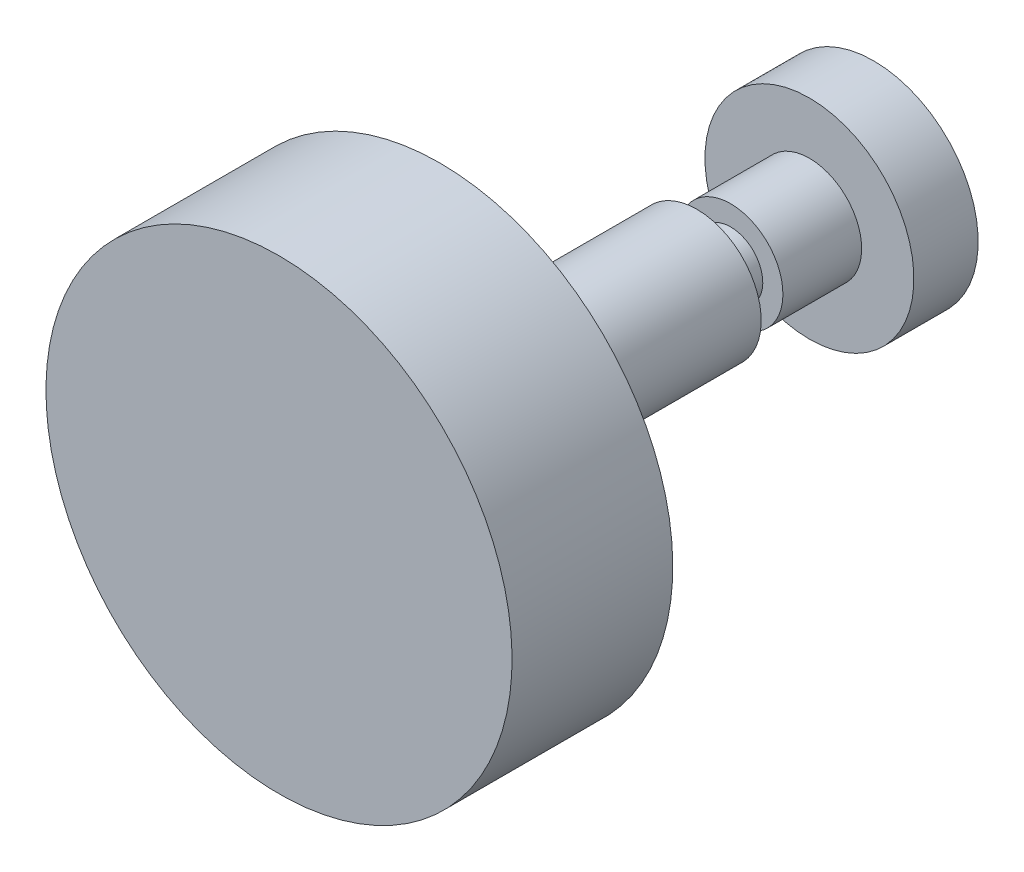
ISO-10303-21;
HEADER;
FILE_DESCRIPTION(('STEP AP214'),'2;1');
FILE_NAME('part.step','',(''),(''),'','','');
FILE_SCHEMA(('AUTOMOTIVE_DESIGN { 1 0 10303 214 1 1 1 1 }'));
ENDSEC;
DATA;
#1=APPLICATION_CONTEXT('core data for automotive mechanical design processes');
#2=APPLICATION_PROTOCOL_DEFINITION('international standard','automotive_design',2000,#1);
#3=PRODUCT_CONTEXT('',#1,'mechanical');
#4=PRODUCT('Part','Part','',(#3));
#5=PRODUCT_RELATED_PRODUCT_CATEGORY('part','',(#4));
#6=PRODUCT_DEFINITION_FORMATION('','',#4);
#7=PRODUCT_DEFINITION_CONTEXT('part definition',#1,'design');
#8=PRODUCT_DEFINITION('design','',#6,#7);
#9=PRODUCT_DEFINITION_SHAPE('','',#8);
#10=(LENGTH_UNIT() NAMED_UNIT(*) SI_UNIT(.MILLI.,.METRE.));
#11=(NAMED_UNIT(*) PLANE_ANGLE_UNIT() SI_UNIT($,.RADIAN.));
#12=(NAMED_UNIT(*) SI_UNIT($,.STERADIAN.) SOLID_ANGLE_UNIT());
#13=UNCERTAINTY_MEASURE_WITH_UNIT(LENGTH_MEASURE(1.E-05),#10,'distance_accuracy_value','');
#14=(GEOMETRIC_REPRESENTATION_CONTEXT(3) GLOBAL_UNCERTAINTY_ASSIGNED_CONTEXT((#13)) GLOBAL_UNIT_ASSIGNED_CONTEXT((#10,
#11,#12)) REPRESENTATION_CONTEXT('',''));
#15=CARTESIAN_POINT('',(0.,0.,0.));
#16=DIRECTION('',(0.,0.,1.));
#17=DIRECTION('',(1.,0.,0.));
#18=AXIS2_PLACEMENT_3D('',#15,#16,#17);
#19=CARTESIAN_POINT('',(0.,0.,0.));
#20=DIRECTION('',(0.,0.,1.));
#21=DIRECTION('',(0.,1.,0.));
#22=AXIS2_PLACEMENT_3D('',#19,#20,#21);
#23=PLANE('',#22);
#24=CARTESIAN_POINT('',(0.,0.,0.));
#25=DIRECTION('',(0.,0.,1.));
#26=DIRECTION('',(0.,1.,0.));
#27=AXIS2_PLACEMENT_3D('',#24,#25,#26);
#28=CIRCLE('',#27,6.5);
#29=CARTESIAN_POINT('',(0.,6.5,0.));
#30=VERTEX_POINT('',#29);
#31=EDGE_CURVE('E8',#30,#30,#28,.T.);
#32=ORIENTED_EDGE('',*,*,#31,.F.);
#33=EDGE_LOOP('',(#32));
#34=FACE_BOUND('',#33,.T.);
#35=ADVANCED_FACE('F12',(#34),#23,.F.);
#36=CARTESIAN_POINT('',(0.,0.,50.));
#37=DIRECTION('',(0.,0.,1.));
#38=DIRECTION('',(0.,1.,0.));
#39=AXIS2_PLACEMENT_3D('',#36,#37,#38);
#40=CYLINDRICAL_SURFACE('',#39,6.5);
#41=CARTESIAN_POINT('',(0.,0.,4.));
#42=DIRECTION('',(0.,0.,1.));
#43=DIRECTION('',(0.,1.,0.));
#44=AXIS2_PLACEMENT_3D('',#41,#42,#43);
#45=CIRCLE('',#44,6.5);
#46=CARTESIAN_POINT('',(0.,6.5,4.));
#47=VERTEX_POINT('',#46);
#48=EDGE_CURVE('E18',#47,#47,#45,.T.);
#49=ORIENTED_EDGE('',*,*,#48,.F.);
#50=EDGE_LOOP('',(#49));
#51=FACE_BOUND('',#50,.T.);
#52=ORIENTED_EDGE('',*,*,#31,.T.);
#53=EDGE_LOOP('',(#52));
#54=FACE_BOUND('',#53,.T.);
#55=ADVANCED_FACE('F71',(#51,#54),#40,.T.);
#56=CARTESIAN_POINT('',(0.,-6.5,4.));
#57=DIRECTION('',(0.,0.,-1.));
#58=DIRECTION('',(0.,-1.,0.));
#59=AXIS2_PLACEMENT_3D('',#56,#57,#58);
#60=PLANE('',#59);
#61=CARTESIAN_POINT('',(0.,0.,4.));
#62=DIRECTION('',(0.,0.,1.));
#63=DIRECTION('',(0.,1.,0.));
#64=AXIS2_PLACEMENT_3D('',#61,#62,#63);
#65=CIRCLE('',#64,3.25);
#66=CARTESIAN_POINT('',(0.,3.25,4.));
#67=VERTEX_POINT('',#66);
#68=EDGE_CURVE('E22',#67,#67,#65,.T.);
#69=ORIENTED_EDGE('',*,*,#68,.F.);
#70=EDGE_LOOP('',(#69));
#71=FACE_BOUND('',#70,.T.);
#72=ORIENTED_EDGE('',*,*,#48,.T.);
#73=EDGE_LOOP('',(#72));
#74=FACE_BOUND('',#73,.T.);
#75=ADVANCED_FACE('F76',(#71,#74),#60,.F.);
#76=CARTESIAN_POINT('',(0.,0.,50.));
#77=DIRECTION('',(0.,0.,1.));
#78=DIRECTION('',(0.,1.,0.));
#79=AXIS2_PLACEMENT_3D('',#76,#77,#78);
#80=CYLINDRICAL_SURFACE('',#79,3.25);
#81=CARTESIAN_POINT('',(0.,0.,8.9));
#82=DIRECTION('',(0.,0.,1.));
#83=DIRECTION('',(0.,1.,0.));
#84=AXIS2_PLACEMENT_3D('',#81,#82,#83);
#85=CIRCLE('',#84,3.25);
#86=CARTESIAN_POINT('',(0.,3.25,8.9));
#87=VERTEX_POINT('',#86);
#88=EDGE_CURVE('E26',#87,#87,#85,.T.);
#89=ORIENTED_EDGE('',*,*,#88,.F.);
#90=EDGE_LOOP('',(#89));
#91=FACE_BOUND('',#90,.T.);
#92=ORIENTED_EDGE('',*,*,#68,.T.);
#93=EDGE_LOOP('',(#92));
#94=FACE_BOUND('',#93,.T.);
#95=ADVANCED_FACE('F81',(#91,#94),#80,.T.);
#96=CARTESIAN_POINT('',(0.,-3.25,8.9));
#97=DIRECTION('',(0.,0.,-1.));
#98=DIRECTION('',(0.,-1.,0.));
#99=AXIS2_PLACEMENT_3D('',#96,#97,#98);
#100=PLANE('',#99);
#101=CARTESIAN_POINT('',(0.,0.,8.9));
#102=DIRECTION('',(0.,0.,1.));
#103=DIRECTION('',(0.,1.,0.));
#104=AXIS2_PLACEMENT_3D('',#101,#102,#103);
#105=CIRCLE('',#104,2.);
#106=CARTESIAN_POINT('',(0.,2.,8.9));
#107=VERTEX_POINT('',#106);
#108=EDGE_CURVE('E31',#107,#107,#105,.T.);
#109=ORIENTED_EDGE('',*,*,#108,.F.);
#110=EDGE_LOOP('',(#109));
#111=FACE_BOUND('',#110,.T.);
#112=ORIENTED_EDGE('',*,*,#88,.T.);
#113=EDGE_LOOP('',(#112));
#114=FACE_BOUND('',#113,.T.);
#115=ADVANCED_FACE('F87',(#111,#114),#100,.F.);
#116=CARTESIAN_POINT('',(0.,0.,50.));
#117=DIRECTION('',(0.,0.,1.));
#118=DIRECTION('',(0.,1.,0.));
#119=AXIS2_PLACEMENT_3D('',#116,#117,#118);
#120=CYLINDRICAL_SURFACE('',#119,2.);
#121=CARTESIAN_POINT('',(0.,0.,11.));
#122=DIRECTION('',(0.,0.,1.));
#123=DIRECTION('',(0.,1.,0.));
#124=AXIS2_PLACEMENT_3D('',#121,#122,#123);
#125=CIRCLE('',#124,2.);
#126=CARTESIAN_POINT('',(0.,2.,11.));
#127=VERTEX_POINT('',#126);
#128=EDGE_CURVE('E34',#127,#127,#125,.T.);
#129=ORIENTED_EDGE('',*,*,#128,.F.);
#130=EDGE_LOOP('',(#129));
#131=FACE_BOUND('',#130,.T.);
#132=ORIENTED_EDGE('',*,*,#108,.T.);
#133=EDGE_LOOP('',(#132));
#134=FACE_BOUND('',#133,.T.);
#135=ADVANCED_FACE('F91',(#131,#134),#120,.T.);
#136=CARTESIAN_POINT('',(0.,-2.,11.));
#137=DIRECTION('',(0.,0.,1.));
#138=DIRECTION('',(0.,1.,0.));
#139=AXIS2_PLACEMENT_3D('',#136,#137,#138);
#140=PLANE('',#139);
#141=CARTESIAN_POINT('',(0.,0.,11.));
#142=DIRECTION('',(0.,0.,1.));
#143=DIRECTION('',(0.,1.,0.));
#144=AXIS2_PLACEMENT_3D('',#141,#142,#143);
#145=CIRCLE('',#144,4.);
#146=CARTESIAN_POINT('',(0.,4.,11.));
#147=VERTEX_POINT('',#146);
#148=EDGE_CURVE('E37',#147,#147,#145,.T.);
#149=ORIENTED_EDGE('',*,*,#148,.F.);
#150=EDGE_LOOP('',(#149));
#151=FACE_BOUND('',#150,.T.);
#152=ORIENTED_EDGE('',*,*,#128,.T.);
#153=EDGE_LOOP('',(#152));
#154=FACE_BOUND('',#153,.T.);
#155=ADVANCED_FACE('F67',(#151,#154),#140,.F.);
#156=CARTESIAN_POINT('',(0.,0.,50.));
#157=DIRECTION('',(0.,0.,1.));
#158=DIRECTION('',(0.,1.,0.));
#159=AXIS2_PLACEMENT_3D('',#156,#157,#158);
#160=CYLINDRICAL_SURFACE('',#159,4.);
#161=CARTESIAN_POINT('',(0.,0.,27.));
#162=DIRECTION('',(0.,0.,1.));
#163=DIRECTION('',(0.,1.,0.));
#164=AXIS2_PLACEMENT_3D('',#161,#162,#163);
#165=CIRCLE('',#164,4.);
#166=CARTESIAN_POINT('',(0.,4.,27.));
#167=VERTEX_POINT('',#166);
#168=EDGE_CURVE('E40',#167,#167,#165,.T.);
#169=ORIENTED_EDGE('',*,*,#168,.F.);
#170=EDGE_LOOP('',(#169));
#171=FACE_BOUND('',#170,.T.);
#172=ORIENTED_EDGE('',*,*,#148,.T.);
#173=EDGE_LOOP('',(#172));
#174=FACE_BOUND('',#173,.T.);
#175=ADVANCED_FACE('F60',(#171,#174),#160,.T.);
#176=CARTESIAN_POINT('',(0.,-14.5,27.));
#177=DIRECTION('',(0.,0.,-1.));
#178=DIRECTION('',(0.,-1.,0.));
#179=AXIS2_PLACEMENT_3D('',#176,#177,#178);
#180=PLANE('',#179);
#181=ORIENTED_EDGE('',*,*,#168,.T.);
#182=EDGE_LOOP('',(#181));
#183=FACE_BOUND('',#182,.T.);
#184=CARTESIAN_POINT('',(0.,0.,27.));
#185=DIRECTION('',(0.,0.,1.));
#186=DIRECTION('',(0.,1.,0.));
#187=AXIS2_PLACEMENT_3D('',#184,#185,#186);
#188=CIRCLE('',#187,14.5);
#189=CARTESIAN_POINT('',(0.,14.5,27.));
#190=VERTEX_POINT('',#189);
#191=EDGE_CURVE('E43',#190,#190,#188,.T.);
#192=ORIENTED_EDGE('',*,*,#191,.F.);
#193=EDGE_LOOP('',(#192));
#194=FACE_BOUND('',#193,.T.);
#195=ADVANCED_FACE('F55',(#183,#194),#180,.T.);
#196=CARTESIAN_POINT('',(0.,0.,50.));
#197=DIRECTION('',(0.,0.,1.));
#198=DIRECTION('',(0.,1.,0.));
#199=AXIS2_PLACEMENT_3D('',#196,#197,#198);
#200=CYLINDRICAL_SURFACE('',#199,14.5);
#201=CARTESIAN_POINT('',(0.,0.,37.));
#202=DIRECTION('',(0.,0.,1.));
#203=DIRECTION('',(0.,1.,0.));
#204=AXIS2_PLACEMENT_3D('',#201,#202,#203);
#205=CIRCLE('',#204,14.5);
#206=CARTESIAN_POINT('',(0.,14.5,37.));
#207=VERTEX_POINT('',#206);
#208=EDGE_CURVE('E46',#207,#207,#205,.T.);
#209=ORIENTED_EDGE('',*,*,#208,.F.);
#210=EDGE_LOOP('',(#209));
#211=FACE_BOUND('',#210,.T.);
#212=ORIENTED_EDGE('',*,*,#191,.T.);
#213=EDGE_LOOP('',(#212));
#214=FACE_BOUND('',#213,.T.);
#215=ADVANCED_FACE('F52',(#211,#214),#200,.T.);
#216=CARTESIAN_POINT('',(0.,-14.5,37.));
#217=DIRECTION('',(0.,0.,-1.));
#218=DIRECTION('',(0.,-1.,0.));
#219=AXIS2_PLACEMENT_3D('',#216,#217,#218);
#220=PLANE('',#219);
#221=ORIENTED_EDGE('',*,*,#208,.T.);
#222=EDGE_LOOP('',(#221));
#223=FACE_BOUND('',#222,.T.);
#224=ADVANCED_FACE('F50',(#223),#220,.F.);
#225=CLOSED_SHELL('',(#35,#55,#75,#95,#115,#135,#155,#175,#195,#215,#224));
#226=MANIFOLD_SOLID_BREP('B1',#225);
#227=ADVANCED_BREP_SHAPE_REPRESENTATION('',(#18,#226),#14);
#228=SHAPE_DEFINITION_REPRESENTATION(#9,#227);
ENDSEC;
END-ISO-10303-21;
